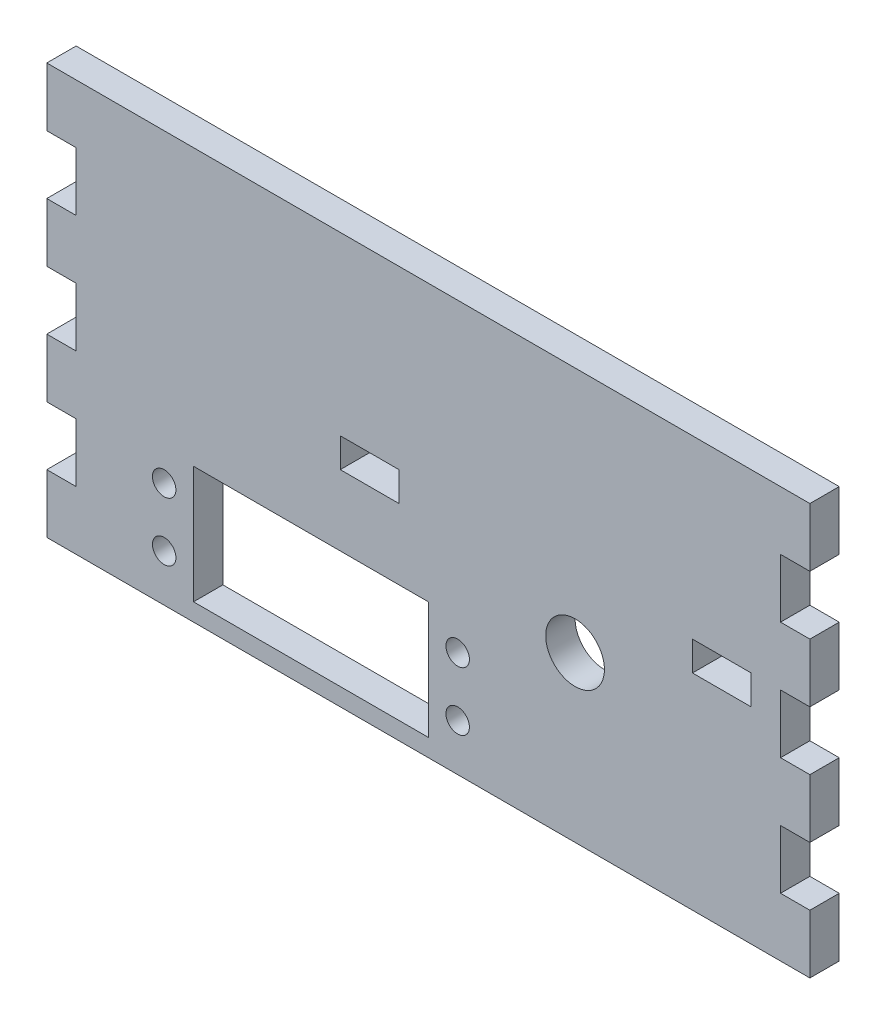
from build123d import *

# Parameters (mm, degrees)
ESQUISSE1_W             = 120
ESQUISSE1_H             = 70
ESQUISSE1_W_2           = 10
ESQUISSE1_H_2           = 5
BOSS_EXTRU_1_DEPTH      = 5
ESQUISSE2_R             = 5
ENL_V_MAT_EXTRU_1_DEPTH = 5
ESQUISSE3_W             = 40
ESQUISSE3_H             = 20
ENL_V_MAT_EXTRU_2_DEPTH = 10
ESQUISSE4_W             = 5
ESQUISSE4_H             = 10
BOSS_EXTRU_2_DEPTH      = 5
ESQUISSE5_W             = 5
ESQUISSE5_H             = 10
BOSS_EXTRU_3_DEPTH      = 5
ESQUISSE6_R             = 2
ENL_V_MAT_EXTRU_3_DEPTH = 10


with BuildPart() as part:
    # Esquisse1 → Boss.-Extru.1 (new body)
    with BuildSketch(Plane.XY):
        with Locations((15, 0)):
            Rectangle(ESQUISSE1_W, ESQUISSE1_H)
        with Locations((5, 2.5)):
            Rectangle(ESQUISSE1_W_2, ESQUISSE1_H_2, mode=Mode.SUBTRACT)
        with Locations((65, 2.5)):
            Rectangle(ESQUISSE1_W_2, ESQUISSE1_H_2, mode=Mode.SUBTRACT)
    extrude(amount=BOSS_EXTRU_1_DEPTH)

    # Esquisse2 → Enl_v. mat.-Extru.1 (cut)
    with BuildSketch(Plane.XY.offset(5)):
        with Locations((40, -7)):
            Circle(ESQUISSE2_R)
    extrude(amount=-ENL_V_MAT_EXTRU_1_DEPTH, mode=Mode.SUBTRACT)

    # Esquisse3 → Enl_v. mat.-Extru.2 (cut)
    with BuildSketch(Plane.XY.offset(5)):
        with Locations((-5, -22)):
            Rectangle(ESQUISSE3_W, ESQUISSE3_H)
    extrude(amount=-ENL_V_MAT_EXTRU_2_DEPTH, mode=Mode.SUBTRACT)

    # Esquisse4 → Boss.-Extru.2 (add)
    with BuildSketch(Plane(origin=(75, 0, 0), x_dir=(0, 0, -1), z_dir=(1, 0, 0))):
        with Locations((-2.5, -30)):
            Rectangle(ESQUISSE4_W, ESQUISSE4_H)
        with Locations((-2.5, -10)):
            Rectangle(ESQUISSE4_W, ESQUISSE4_H)
        with Locations((-2.5, 10)):
            Rectangle(ESQUISSE4_W, ESQUISSE4_H)
        with Locations((-2.5, 30)):
            Rectangle(ESQUISSE4_W, ESQUISSE4_H)
    extrude(amount=BOSS_EXTRU_2_DEPTH)

    # Esquisse5 → Boss.-Extru.3 (add)
    with BuildSketch(Plane.ZY.offset(45)):
        with Locations((2.5, 30)):
            Rectangle(ESQUISSE5_W, ESQUISSE5_H)
        with Locations((2.5, 10)):
            Rectangle(ESQUISSE5_W, ESQUISSE5_H)
        with Locations((2.5, -10)):
            Rectangle(ESQUISSE5_W, ESQUISSE5_H)
        with Locations((2.5, -30)):
            Rectangle(ESQUISSE5_W, ESQUISSE5_H)
    extrude(amount=BOSS_EXTRU_3_DEPTH)

    # Esquisse6 → Enl_v. mat.-Extru.3 (cut)
    with BuildSketch(Plane.XY.offset(5)):
        with Locations((-30, -27)):
            Circle(ESQUISSE6_R)
        with Locations((-30, -17)):
            Circle(ESQUISSE6_R)
        with Locations((20, -27)):
            Circle(ESQUISSE6_R)
        with Locations((20, -17)):
            Circle(ESQUISSE6_R)
    extrude(amount=-ENL_V_MAT_EXTRU_3_DEPTH, mode=Mode.SUBTRACT)


solid = part.part
